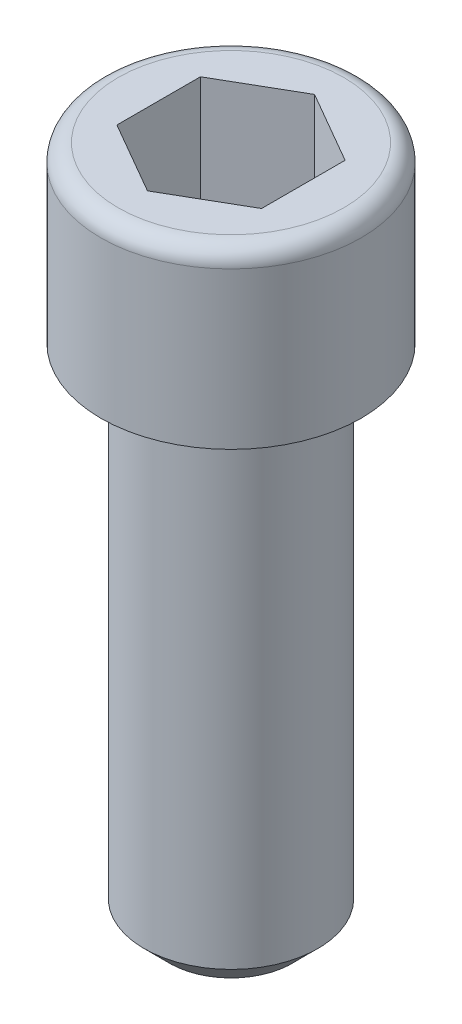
ISO-10303-21;
HEADER;
FILE_DESCRIPTION(('STEP AP214'),'2;1');
FILE_NAME('part.step','',(''),(''),'','','');
FILE_SCHEMA(('AUTOMOTIVE_DESIGN { 1 0 10303 214 1 1 1 1 }'));
ENDSEC;
DATA;
#1=APPLICATION_CONTEXT('core data for automotive mechanical design processes');
#2=APPLICATION_PROTOCOL_DEFINITION('international standard','automotive_design',2000,#1);
#3=PRODUCT_CONTEXT('',#1,'mechanical');
#4=PRODUCT('Part','Part','',(#3));
#5=PRODUCT_RELATED_PRODUCT_CATEGORY('part','',(#4));
#6=PRODUCT_DEFINITION_FORMATION('','',#4);
#7=PRODUCT_DEFINITION_CONTEXT('part definition',#1,'design');
#8=PRODUCT_DEFINITION('design','',#6,#7);
#9=PRODUCT_DEFINITION_SHAPE('','',#8);
#10=(LENGTH_UNIT() NAMED_UNIT(*) SI_UNIT(.MILLI.,.METRE.));
#11=(NAMED_UNIT(*) PLANE_ANGLE_UNIT() SI_UNIT($,.RADIAN.));
#12=(NAMED_UNIT(*) SI_UNIT($,.STERADIAN.) SOLID_ANGLE_UNIT());
#13=UNCERTAINTY_MEASURE_WITH_UNIT(LENGTH_MEASURE(1.E-05),#10,'distance_accuracy_value','');
#14=(GEOMETRIC_REPRESENTATION_CONTEXT(3) GLOBAL_UNCERTAINTY_ASSIGNED_CONTEXT((#13)) GLOBAL_UNIT_ASSIGNED_CONTEXT((#10,
#11,#12)) REPRESENTATION_CONTEXT('',''));
#15=CARTESIAN_POINT('',(0.,0.,0.));
#16=DIRECTION('',(0.,0.,1.));
#17=DIRECTION('',(1.,0.,0.));
#18=AXIS2_PLACEMENT_3D('',#15,#16,#17);
#19=CARTESIAN_POINT('',(4.25000000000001,-47.,0.));
#20=DIRECTION('',(0.,-1.,0.));
#21=DIRECTION('',(1.,0.,0.));
#22=AXIS2_PLACEMENT_3D('',#19,#20,#21);
#23=PLANE('',#22);
#24=CARTESIAN_POINT('',(0.,-47.,0.));
#25=DIRECTION('',(0.,1.,0.));
#26=DIRECTION('',(-1.,0.,0.));
#27=AXIS2_PLACEMENT_3D('',#24,#25,#26);
#28=CIRCLE('',#27,4.25);
#29=CARTESIAN_POINT('',(-4.24999999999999,-47.,0.));
#30=VERTEX_POINT('',#29);
#31=EDGE_CURVE('E11',#30,#30,#28,.T.);
#32=ORIENTED_EDGE('',*,*,#31,.F.);
#33=EDGE_LOOP('',(#32));
#34=FACE_BOUND('',#33,.T.);
#35=ADVANCED_FACE('F26',(#34),#23,.T.);
#36=CARTESIAN_POINT('',(0.,-47.,0.));
#37=DIRECTION('',(0.,1.,0.));
#38=DIRECTION('',(-1.,0.,0.));
#39=AXIS2_PLACEMENT_3D('',#36,#37,#38);
#40=CONICAL_SURFACE('',#39,4.25,0.785398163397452);
#41=CARTESIAN_POINT('',(0.,-45.25,0.));
#42=DIRECTION('',(0.,1.,0.));
#43=DIRECTION('',(-1.,0.,0.));
#44=AXIS2_PLACEMENT_3D('',#41,#42,#43);
#45=CIRCLE('',#44,6.);
#46=CARTESIAN_POINT('',(-5.99999999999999,-45.25,0.));
#47=VERTEX_POINT('',#46);
#48=EDGE_CURVE('E33',#47,#47,#45,.T.);
#49=ORIENTED_EDGE('',*,*,#48,.F.);
#50=EDGE_LOOP('',(#49));
#51=FACE_BOUND('',#50,.T.);
#52=ORIENTED_EDGE('',*,*,#31,.T.);
#53=EDGE_LOOP('',(#52));
#54=FACE_BOUND('',#53,.T.);
#55=ADVANCED_FACE('F148',(#51,#54),#40,.T.);
#56=CARTESIAN_POINT('',(0.,65.1172922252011,0.));
#57=DIRECTION('',(0.,1.,0.));
#58=DIRECTION('',(-1.,0.,0.));
#59=AXIS2_PLACEMENT_3D('',#56,#57,#58);
#60=CYLINDRICAL_SURFACE('',#59,5.99999999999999);
#61=ORIENTED_EDGE('',*,*,#48,.T.);
#62=EDGE_LOOP('',(#61));
#63=FACE_BOUND('',#62,.T.);
#64=CARTESIAN_POINT('',(0.,-12.,0.));
#65=DIRECTION('',(0.,1.,0.));
#66=DIRECTION('',(-1.,0.,0.));
#67=AXIS2_PLACEMENT_3D('',#64,#65,#66);
#68=CIRCLE('',#67,5.99999999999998);
#69=CARTESIAN_POINT('',(-5.99999999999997,-12.,0.));
#70=VERTEX_POINT('',#69);
#71=EDGE_CURVE('E140',#70,#70,#68,.T.);
#72=ORIENTED_EDGE('',*,*,#71,.F.);
#73=EDGE_LOOP('',(#72));
#74=FACE_BOUND('',#73,.T.);
#75=ADVANCED_FACE('F145',(#63,#74),#60,.T.);
#76=CARTESIAN_POINT('',(5.99999999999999,-12.,0.));
#77=DIRECTION('',(0.,1.,0.));
#78=DIRECTION('',(-1.,0.,0.));
#79=AXIS2_PLACEMENT_3D('',#76,#77,#78);
#80=PLANE('',#79);
#81=CARTESIAN_POINT('',(0.,-12.,0.));
#82=DIRECTION('',(0.,1.,0.));
#83=DIRECTION('',(-1.,0.,0.));
#84=AXIS2_PLACEMENT_3D('',#81,#82,#83);
#85=CIRCLE('',#84,8.99999999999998);
#86=CARTESIAN_POINT('',(-8.99999999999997,-12.,0.));
#87=VERTEX_POINT('',#86);
#88=EDGE_CURVE('E137',#87,#87,#85,.T.);
#89=ORIENTED_EDGE('',*,*,#88,.F.);
#90=EDGE_LOOP('',(#89));
#91=FACE_BOUND('',#90,.T.);
#92=ORIENTED_EDGE('',*,*,#71,.T.);
#93=EDGE_LOOP('',(#92));
#94=FACE_BOUND('',#93,.T.);
#95=ADVANCED_FACE('F166',(#91,#94),#80,.F.);
#96=CARTESIAN_POINT('',(0.,65.1172922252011,0.));
#97=DIRECTION('',(0.,1.,0.));
#98=DIRECTION('',(-1.,0.,0.));
#99=AXIS2_PLACEMENT_3D('',#96,#97,#98);
#100=CYLINDRICAL_SURFACE('',#99,8.99999999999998);
#101=CARTESIAN_POINT('',(0.,-1.20000000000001,0.));
#102=DIRECTION('',(0.,1.,0.));
#103=DIRECTION('',(-1.,0.,0.));
#104=AXIS2_PLACEMENT_3D('',#101,#102,#103);
#105=CIRCLE('',#104,8.99999999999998);
#106=CARTESIAN_POINT('',(-8.99999999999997,-1.20000000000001,0.));
#107=VERTEX_POINT('',#106);
#108=EDGE_CURVE('E134',#107,#107,#105,.T.);
#109=ORIENTED_EDGE('',*,*,#108,.F.);
#110=EDGE_LOOP('',(#109));
#111=FACE_BOUND('',#110,.T.);
#112=ORIENTED_EDGE('',*,*,#88,.T.);
#113=EDGE_LOOP('',(#112));
#114=FACE_BOUND('',#113,.T.);
#115=ADVANCED_FACE('F173',(#111,#114),#100,.T.);
#116=CARTESIAN_POINT('',(0.,-1.20000000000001,0.));
#117=DIRECTION('',(0.,1.,0.));
#118=DIRECTION('',(-1.,0.,0.));
#119=AXIS2_PLACEMENT_3D('',#116,#117,#118);
#120=TOROIDAL_SURFACE('',#119,7.79999999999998,1.2);
#121=CARTESIAN_POINT('',(0.,0.,0.));
#122=DIRECTION('',(0.,1.,0.));
#123=DIRECTION('',(-1.,0.,0.));
#124=AXIS2_PLACEMENT_3D('',#121,#122,#123);
#125=CIRCLE('',#124,7.79999999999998);
#126=CARTESIAN_POINT('',(-7.79999999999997,0.,0.));
#127=VERTEX_POINT('',#126);
#128=EDGE_CURVE('E125',#127,#127,#125,.T.);
#129=ORIENTED_EDGE('',*,*,#128,.F.);
#130=EDGE_LOOP('',(#129));
#131=FACE_BOUND('',#130,.T.);
#132=ORIENTED_EDGE('',*,*,#108,.T.);
#133=EDGE_LOOP('',(#132));
#134=FACE_BOUND('',#133,.T.);
#135=ADVANCED_FACE('F181',(#131,#134),#120,.T.);
#136=CARTESIAN_POINT('',(7.79999999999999,0.,0.));
#137=DIRECTION('',(0.,-1.,0.));
#138=DIRECTION('',(1.,0.,0.));
#139=AXIS2_PLACEMENT_3D('',#136,#137,#138);
#140=PLANE('',#139);
#141=DIRECTION('',(0.,0.,1.));
#142=VECTOR('',#141,1.);
#143=CARTESIAN_POINT('',(-5.,0.,-2.88675134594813));
#144=LINE('',#143,#142);
#145=CARTESIAN_POINT('',(-5.,0.,-2.88675134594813));
#146=VERTEX_POINT('',#145);
#147=CARTESIAN_POINT('',(-5.,0.,2.88675134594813));
#148=VERTEX_POINT('',#147);
#149=EDGE_CURVE('E94',#146,#148,#144,.T.);
#150=ORIENTED_EDGE('',*,*,#149,.F.);
#151=DIRECTION('',(-0.866025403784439,0.,0.5));
#152=VECTOR('',#151,1.);
#153=CARTESIAN_POINT('',(0.,0.,-5.77350269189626));
#154=LINE('',#153,#152);
#155=CARTESIAN_POINT('',(0.,0.,-5.77350269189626));
#156=VERTEX_POINT('',#155);
#157=EDGE_CURVE('E40',#156,#146,#154,.T.);
#158=ORIENTED_EDGE('',*,*,#157,.F.);
#159=DIRECTION('',(0.866025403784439,0.,0.5));
#160=VECTOR('',#159,1.);
#161=CARTESIAN_POINT('',(0.,0.,-5.77350269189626));
#162=LINE('',#161,#160);
#163=CARTESIAN_POINT('',(5.,0.,-2.88675134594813));
#164=VERTEX_POINT('',#163);
#165=EDGE_CURVE('E109',#156,#164,#162,.T.);
#166=ORIENTED_EDGE('',*,*,#165,.T.);
#167=DIRECTION('',(0.,0.,1.));
#168=VECTOR('',#167,1.);
#169=CARTESIAN_POINT('',(5.,0.,-2.88675134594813));
#170=LINE('',#169,#168);
#171=CARTESIAN_POINT('',(5.,0.,2.88675134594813));
#172=VERTEX_POINT('',#171);
#173=EDGE_CURVE('E104',#164,#172,#170,.T.);
#174=ORIENTED_EDGE('',*,*,#173,.T.);
#175=DIRECTION('',(-0.866025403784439,0.,0.5));
#176=VECTOR('',#175,1.);
#177=CARTESIAN_POINT('',(5.,0.,2.88675134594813));
#178=LINE('',#177,#176);
#179=CARTESIAN_POINT('',(0.,0.,5.77350269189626));
#180=VERTEX_POINT('',#179);
#181=EDGE_CURVE('E102',#172,#180,#178,.T.);
#182=ORIENTED_EDGE('',*,*,#181,.T.);
#183=DIRECTION('',(0.866025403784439,0.,0.5));
#184=VECTOR('',#183,1.);
#185=CARTESIAN_POINT('',(-5.,0.,2.88675134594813));
#186=LINE('',#185,#184);
#187=EDGE_CURVE('E83',#148,#180,#186,.T.);
#188=ORIENTED_EDGE('',*,*,#187,.F.);
#189=EDGE_LOOP('',(#150,#158,#166,#174,#182,#188));
#190=FACE_BOUND('',#189,.T.);
#191=ORIENTED_EDGE('',*,*,#128,.T.);
#192=EDGE_LOOP('',(#191));
#193=FACE_BOUND('',#192,.T.);
#194=ADVANCED_FACE('F98',(#190,#193),#140,.F.);
#195=CARTESIAN_POINT('',(0.,-8.64,-5.77350269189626));
#196=DIRECTION('',(-0.5,0.,-0.866025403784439));
#197=DIRECTION('',(-0.866025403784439,0.,0.5));
#198=AXIS2_PLACEMENT_3D('',#195,#196,#197);
#199=PLANE('',#198);
#200=ORIENTED_EDGE('',*,*,#157,.T.);
#201=DIRECTION('',(0.,1.,0.));
#202=VECTOR('',#201,1.);
#203=CARTESIAN_POINT('',(-5.,-8.64,-2.88675134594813));
#204=LINE('',#203,#202);
#205=CARTESIAN_POINT('',(-5.,-8.64,-2.88675134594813));
#206=VERTEX_POINT('',#205);
#207=EDGE_CURVE('E91',#206,#146,#204,.T.);
#208=ORIENTED_EDGE('',*,*,#207,.F.);
#209=DIRECTION('',(-0.866025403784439,0.,0.5));
#210=VECTOR('',#209,1.);
#211=CARTESIAN_POINT('',(0.,-8.64,-5.77350269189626));
#212=LINE('',#211,#210);
#213=CARTESIAN_POINT('',(0.,-8.64,-5.77350269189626));
#214=VERTEX_POINT('',#213);
#215=EDGE_CURVE('E112',#214,#206,#212,.T.);
#216=ORIENTED_EDGE('',*,*,#215,.F.);
#217=DIRECTION('',(0.,1.,0.));
#218=VECTOR('',#217,1.);
#219=CARTESIAN_POINT('',(0.,-8.64,-5.77350269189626));
#220=LINE('',#219,#218);
#221=EDGE_CURVE('E47',#214,#156,#220,.T.);
#222=ORIENTED_EDGE('',*,*,#221,.T.);
#223=EDGE_LOOP('',(#200,#208,#216,#222));
#224=FACE_BOUND('',#223,.T.);
#225=ADVANCED_FACE('F196',(#224),#199,.F.);
#226=CARTESIAN_POINT('',(0.,-8.64,-5.77350269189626));
#227=DIRECTION('',(-0.5,0.,0.866025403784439));
#228=DIRECTION('',(0.866025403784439,0.,0.5));
#229=AXIS2_PLACEMENT_3D('',#226,#227,#228);
#230=PLANE('',#229);
#231=ORIENTED_EDGE('',*,*,#165,.F.);
#232=ORIENTED_EDGE('',*,*,#221,.F.);
#233=DIRECTION('',(0.866025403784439,0.,0.5));
#234=VECTOR('',#233,1.);
#235=CARTESIAN_POINT('',(0.,-8.64,-5.77350269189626));
#236=LINE('',#235,#234);
#237=CARTESIAN_POINT('',(5.,-8.64,-2.88675134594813));
#238=VERTEX_POINT('',#237);
#239=EDGE_CURVE('E122',#214,#238,#236,.T.);
#240=ORIENTED_EDGE('',*,*,#239,.T.);
#241=DIRECTION('',(0.,1.,0.));
#242=VECTOR('',#241,1.);
#243=CARTESIAN_POINT('',(5.,-8.64,-2.88675134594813));
#244=LINE('',#243,#242);
#245=EDGE_CURVE('E126',#238,#164,#244,.T.);
#246=ORIENTED_EDGE('',*,*,#245,.T.);
#247=EDGE_LOOP('',(#231,#232,#240,#246));
#248=FACE_BOUND('',#247,.T.);
#249=ADVANCED_FACE('F203',(#248),#230,.T.);
#250=CARTESIAN_POINT('',(5.,-8.64,-2.88675134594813));
#251=DIRECTION('',(-1.,0.,0.));
#252=DIRECTION('',(0.,-1.,0.));
#253=AXIS2_PLACEMENT_3D('',#250,#251,#252);
#254=PLANE('',#253);
#255=ORIENTED_EDGE('',*,*,#173,.F.);
#256=ORIENTED_EDGE('',*,*,#245,.F.);
#257=DIRECTION('',(0.,0.,1.));
#258=VECTOR('',#257,1.);
#259=CARTESIAN_POINT('',(5.,-8.64,-2.88675134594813));
#260=LINE('',#259,#258);
#261=CARTESIAN_POINT('',(5.,-8.64,2.88675134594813));
#262=VERTEX_POINT('',#261);
#263=EDGE_CURVE('E120',#238,#262,#260,.T.);
#264=ORIENTED_EDGE('',*,*,#263,.T.);
#265=DIRECTION('',(0.,1.,0.));
#266=VECTOR('',#265,1.);
#267=CARTESIAN_POINT('',(5.,-8.64,2.88675134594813));
#268=LINE('',#267,#266);
#269=EDGE_CURVE('E128',#262,#172,#268,.T.);
#270=ORIENTED_EDGE('',*,*,#269,.T.);
#271=EDGE_LOOP('',(#255,#256,#264,#270));
#272=FACE_BOUND('',#271,.T.);
#273=ADVANCED_FACE('F210',(#272),#254,.T.);
#274=CARTESIAN_POINT('',(5.,-8.64,2.88675134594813));
#275=DIRECTION('',(-0.5,0.,-0.866025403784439));
#276=DIRECTION('',(-0.866025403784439,0.,0.5));
#277=AXIS2_PLACEMENT_3D('',#274,#275,#276);
#278=PLANE('',#277);
#279=ORIENTED_EDGE('',*,*,#181,.F.);
#280=ORIENTED_EDGE('',*,*,#269,.F.);
#281=DIRECTION('',(-0.866025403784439,0.,0.5));
#282=VECTOR('',#281,1.);
#283=CARTESIAN_POINT('',(5.,-8.64,2.88675134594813));
#284=LINE('',#283,#282);
#285=CARTESIAN_POINT('',(0.,-8.64,5.77350269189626));
#286=VERTEX_POINT('',#285);
#287=EDGE_CURVE('E118',#262,#286,#284,.T.);
#288=ORIENTED_EDGE('',*,*,#287,.T.);
#289=DIRECTION('',(0.,1.,0.));
#290=VECTOR('',#289,1.);
#291=CARTESIAN_POINT('',(0.,-8.64,5.77350269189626));
#292=LINE('',#291,#290);
#293=EDGE_CURVE('E90',#286,#180,#292,.T.);
#294=ORIENTED_EDGE('',*,*,#293,.T.);
#295=EDGE_LOOP('',(#279,#280,#288,#294));
#296=FACE_BOUND('',#295,.T.);
#297=ADVANCED_FACE('F217',(#296),#278,.T.);
#298=CARTESIAN_POINT('',(-5.,-8.64,2.88675134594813));
#299=DIRECTION('',(-0.5,0.,0.866025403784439));
#300=DIRECTION('',(0.866025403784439,0.,0.5));
#301=AXIS2_PLACEMENT_3D('',#298,#299,#300);
#302=PLANE('',#301);
#303=ORIENTED_EDGE('',*,*,#187,.T.);
#304=ORIENTED_EDGE('',*,*,#293,.F.);
#305=DIRECTION('',(0.866025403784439,0.,0.5));
#306=VECTOR('',#305,1.);
#307=CARTESIAN_POINT('',(-5.,-8.64,2.88675134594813));
#308=LINE('',#307,#306);
#309=CARTESIAN_POINT('',(-5.,-8.64,2.88675134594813));
#310=VERTEX_POINT('',#309);
#311=EDGE_CURVE('E86',#310,#286,#308,.T.);
#312=ORIENTED_EDGE('',*,*,#311,.F.);
#313=DIRECTION('',(0.,1.,0.));
#314=VECTOR('',#313,1.);
#315=CARTESIAN_POINT('',(-5.,-8.64,2.88675134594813));
#316=LINE('',#315,#314);
#317=EDGE_CURVE('E78',#310,#148,#316,.T.);
#318=ORIENTED_EDGE('',*,*,#317,.T.);
#319=EDGE_LOOP('',(#303,#304,#312,#318));
#320=FACE_BOUND('',#319,.T.);
#321=ADVANCED_FACE('F80',(#320),#302,.F.);
#322=CARTESIAN_POINT('',(-5.,-8.64,-2.88675134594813));
#323=DIRECTION('',(-1.,0.,0.));
#324=DIRECTION('',(0.,-1.,0.));
#325=AXIS2_PLACEMENT_3D('',#322,#323,#324);
#326=PLANE('',#325);
#327=ORIENTED_EDGE('',*,*,#149,.T.);
#328=ORIENTED_EDGE('',*,*,#317,.F.);
#329=DIRECTION('',(0.,0.,1.));
#330=VECTOR('',#329,1.);
#331=CARTESIAN_POINT('',(-5.,-8.64,-2.88675134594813));
#332=LINE('',#331,#330);
#333=EDGE_CURVE('E115',#206,#310,#332,.T.);
#334=ORIENTED_EDGE('',*,*,#333,.F.);
#335=ORIENTED_EDGE('',*,*,#207,.T.);
#336=EDGE_LOOP('',(#327,#328,#334,#335));
#337=FACE_BOUND('',#336,.T.);
#338=ADVANCED_FACE('F95',(#337),#326,.F.);
#339=CARTESIAN_POINT('',(-5.,-8.64,-2.88675134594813));
#340=DIRECTION('',(0.,1.,0.));
#341=DIRECTION('',(-1.,0.,0.));
#342=AXIS2_PLACEMENT_3D('',#339,#340,#341);
#343=PLANE('',#342);
#344=ORIENTED_EDGE('',*,*,#215,.T.);
#345=ORIENTED_EDGE('',*,*,#333,.T.);
#346=ORIENTED_EDGE('',*,*,#311,.T.);
#347=ORIENTED_EDGE('',*,*,#287,.F.);
#348=ORIENTED_EDGE('',*,*,#263,.F.);
#349=ORIENTED_EDGE('',*,*,#239,.F.);
#350=EDGE_LOOP('',(#344,#345,#346,#347,#348,#349));
#351=FACE_BOUND('',#350,.T.);
#352=ADVANCED_FACE('F238',(#351),#343,.T.);
#353=CLOSED_SHELL('',(#35,#55,#75,#95,#115,#135,#194,#225,#249,#273,#297,#321,#338,#352));
#354=MANIFOLD_SOLID_BREP('B2',#353);
#355=ADVANCED_BREP_SHAPE_REPRESENTATION('',(#18,#354),#14);
#356=SHAPE_DEFINITION_REPRESENTATION(#9,#355);
ENDSEC;
END-ISO-10303-21;
